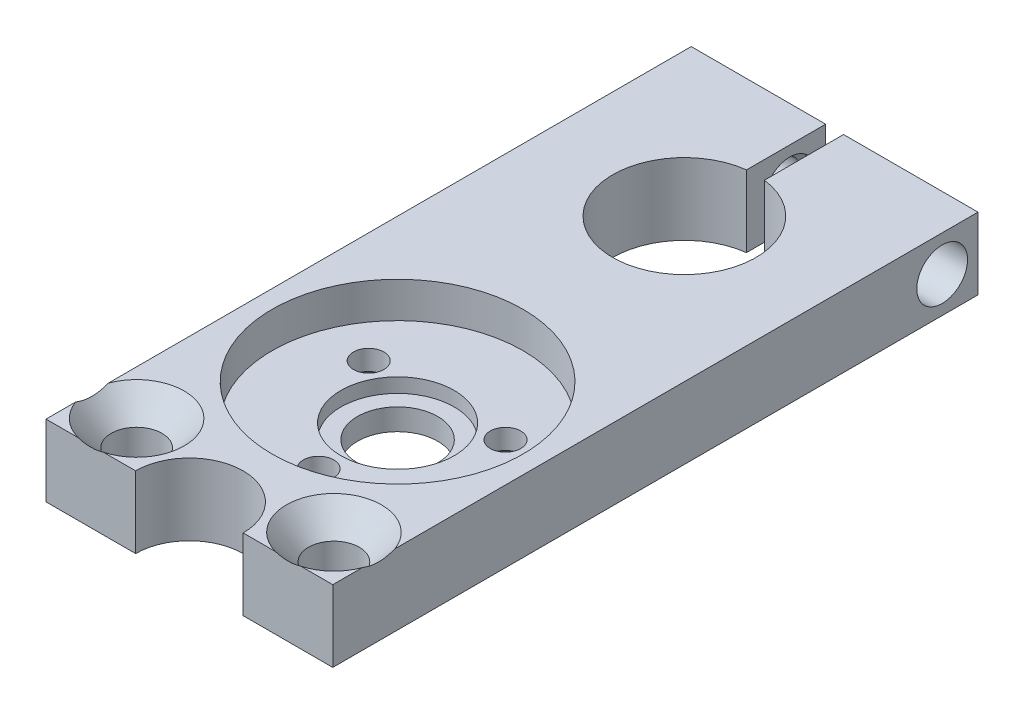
from build123d import *

# Parameters (mm, degrees)
SKETCH1_W                                         = 57.15
SKETCH1_H                                         = 6.35
EXTRUDE1_DEPTH                                    = 12.7
SKETCH2_R                                         = 11.1125
CUT_EXTRUDE1_DEPTH                                = 3.175
SKETCH3_R                                         = 5.0165
CUT_EXTRUDE2_DEPTH                                = 1.27
CUT_EXTRUDE3_REACH                                = 60.713
SKETCH4_R                                         = 3.556
CUT_EXTRUDE4_REACH                                = 60.887
SKETCH5_R                                         = 1.016
CSK_FOR_M2_5_FLAT_HEAD_MACHINE_SCREW1_D           = 2.7
CSK_FOR_M2_5_FLAT_HEAD_MACHINE_SCREW1_CSINK_D     = 5.5
CSK_FOR_M2_5_FLAT_HEAD_MACHINE_SCREW1_CSINK_ANGLE = 90
CUT_EXTRUDE5_REACH                                = 60.887
CUT_EXTRUDE6_REACH                                = 60.887
SKETCH12_R                                        = 4.7625
SKETCH15_W                                        = 1.7272
SKETCH15_H                                        = 11.90625
F_8_CLEARANCE_HOLE1_D                             = 4.4958
F_8_CLEARANCE_HOLE1_DEPTH                         = 13.97
F_8_CLEARANCE_HOLE1_TIP                           = 1.350674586
CSK_FOR_8_FLAT_HEAD_MACHINE_SCREW1_D              = 4.4958
CSK_FOR_8_FLAT_HEAD_MACHINE_SCREW1_CSINK_D        = 8.4328
CSK_FOR_8_FLAT_HEAD_MACHINE_SCREW1_CSINK_ANGLE    = 82


with BuildPart() as part:
    # Sketch1 → Extrude1 (new, symmetric)
    with BuildSketch(Plane(origin=(0, 0, 0), x_dir=(0, 0, -1), z_dir=(1, 0, 0))):
        with Locations((28.575, 0)):
            Rectangle(SKETCH1_W, SKETCH1_H)
    extrude(amount=EXTRUDE1_DEPTH, both=True)

    # Sketch2 → Cut-Extrude1 (cut)
    with BuildSketch(Plane(origin=(0, 3.175, 0), x_dir=(1, 0, 0), z_dir=(0, 1, 0))):
        with Locations(Location((0, 18.4404, 0), (0, 0, 270))):
            Circle(SKETCH2_R)
    extrude(amount=-CUT_EXTRUDE1_DEPTH, mode=Mode.SUBTRACT)

    # Sketch3 → Cut-Extrude2 (cut)
    with BuildSketch(Plane(origin=(0, 0, 0), x_dir=(1, 0, 0), z_dir=(0, 1, 0))):
        with Locations(Location((0, 18.4404, 0), (0, 0, 270))):
            Circle(SKETCH3_R)
    extrude(amount=-CUT_EXTRUDE2_DEPTH, mode=Mode.SUBTRACT)

    # Sketch4 → Cut-Extrude3 (cut, up to next)
    with BuildSketch(Plane(origin=(0, -1.27, 0), x_dir=(1, 0, 0), z_dir=(0, 1, 0)), mode=Mode.PRIVATE) as cut_extrude3_sk1:
        with Locations(Location((0, 18.4404, 0), (0, 0, 270))):
            Circle(SKETCH4_R)
    cut_extrude3_tool1 = extrude(cut_extrude3_sk1.sketch, amount=-CUT_EXTRUDE3_REACH, mode=Mode.PRIVATE) & part.part
    add(cut_extrude3_tool1.solids().sort_by_distance((0, -1.27, -18.4404))[0], mode=Mode.SUBTRACT)

    # Sketch5 → Cut-Extrude4 (cut, up to next)
    with BuildSketch(Plane.XZ.offset(3.175), mode=Mode.PRIVATE) as cut_extrude4_sk1:
        with Locations(Location((0, -11.4427, 0), (0, 0, 270))):
            Circle(SKETCH5_R)
    cut_extrude4_tool1 = extrude(cut_extrude4_sk1.sketch, amount=-CUT_EXTRUDE4_REACH, mode=Mode.PRIVATE) & part.part
    # Sketch5 → Cut-Extrude4 (cut, up to next)
    with BuildSketch(Plane.XZ.offset(3.175), mode=Mode.PRIVATE) as cut_extrude4_sk2:
        with Locations(Location((6.060185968, -21.93925, 0), (0, 0, 270))):
            Circle(SKETCH5_R)
    cut_extrude4_tool2 = extrude(cut_extrude4_sk2.sketch, amount=-CUT_EXTRUDE4_REACH, mode=Mode.PRIVATE) & part.part
    # Sketch5 → Cut-Extrude4 (cut, up to next)
    with BuildSketch(Plane.XZ.offset(3.175), mode=Mode.PRIVATE) as cut_extrude4_sk3:
        with Locations(Location((-6.060185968, -21.93925, 0), (0, 0, 270))):
            Circle(SKETCH5_R)
    cut_extrude4_tool3 = extrude(cut_extrude4_sk3.sketch, amount=-CUT_EXTRUDE4_REACH, mode=Mode.PRIVATE) & part.part
    add(cut_extrude4_tool1.solids().sort_by_distance((0, -3.175, -11.4427))[0], mode=Mode.SUBTRACT)
    add(cut_extrude4_tool2.solids().sort_by_distance((6.060186, -3.175, -21.93925))[0], mode=Mode.SUBTRACT)
    add(cut_extrude4_tool3.solids().sort_by_distance((-6.060186, -3.175, -21.93925))[0], mode=Mode.SUBTRACT)

    # CSK for M2.5 Flat Head Machine Screw1 (through all)
    with Locations(Plane(origin=(6.060185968, -3.175, -21.93925), x_dir=(0, 0, -1), z_dir=(0, -1, 0))):
        with Locations((0, 0), (0, -12.120371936), (-10.49655, -6.060185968)):
            CounterSinkHole(CSK_FOR_M2_5_FLAT_HEAD_MACHINE_SCREW1_D / 2, CSK_FOR_M2_5_FLAT_HEAD_MACHINE_SCREW1_CSINK_D / 2, counter_sink_angle=CSK_FOR_M2_5_FLAT_HEAD_MACHINE_SCREW1_CSINK_ANGLE)

    # Sketch7 → Cut-Extrude5 (cut, up to next)
    with BuildSketch(Plane(origin=(0, 3.175, 0), x_dir=(1, 0, 0), z_dir=(0, 1, 0)), mode=Mode.PRIVATE) as cut_extrude5_sk1:
        with BuildLine():
            Line((-0.79375, 57.15), (0.79375, 57.15))
            Line((0.79375, 57.15), (0.79375, 50.140595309))
            ThreePointArc((0.79375, 50.140595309), (0, 37.4904), (-0.79375, 50.140595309))
            Line((-0.79375, 50.140595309), (-0.79375, 57.15))
        make_face()
    cut_extrude5_tool1 = extrude(cut_extrude5_sk1.sketch, amount=-CUT_EXTRUDE5_REACH, mode=Mode.PRIVATE) & part.part
    add(cut_extrude5_tool1.solids().sort_by_distance((0, 3.175, -44.630009))[0], mode=Mode.SUBTRACT)

    # Sketch12 → Cut-Extrude6 (cut, up to next)
    with BuildSketch(Plane(origin=(0, 3.175, 0), x_dir=(1, 0, 0), z_dir=(0, 1, 0)), mode=Mode.PRIVATE) as cut_extrude6_sk1:
        Circle(SKETCH12_R)
    cut_extrude6_tool1 = extrude(cut_extrude6_sk1.sketch, amount=-CUT_EXTRUDE6_REACH, mode=Mode.PRIVATE) & part.part
    add(cut_extrude6_tool1.solids().sort_by_distance((0, 3.175, 0))[0], mode=Mode.SUBTRACT)

    # Sketch15 → 8-32 Tapped Hole3 (revolve, cut)
    with BuildSketch(Plane(origin=(-0.79375, 0, -53.975), x_dir=(0, 0, -1), z_dir=(0, 1, 0))):
        with Locations((0.8636, 5.953125)):
            Rectangle(SKETCH15_W, SKETCH15_H)
    revolve(axis=Axis((5.55625, 0, -53.975), (-1, 0, 0)), mode=Mode.SUBTRACT)

    # 8 Clearance Hole1
    with Locations(Plane(origin=(12.7, 0, -53.975), x_dir=(0, 0, 1), z_dir=(1, 0, 0))):
        with Locations((0, 0)):
            Hole(F_8_CLEARANCE_HOLE1_D / 2, depth=F_8_CLEARANCE_HOLE1_DEPTH)
            with Locations((0, 0, -(F_8_CLEARANCE_HOLE1_DEPTH + F_8_CLEARANCE_HOLE1_TIP / 2))):  # 118° drill point
                Cone(0, F_8_CLEARANCE_HOLE1_D / 2, F_8_CLEARANCE_HOLE1_TIP, mode=Mode.SUBTRACT)

    # CSK for _8 Flat Head Machine Screw1 (through all)
    with Locations(Plane(origin=(-8.7376, 3.175, -4.064), x_dir=(0, 0, 1), z_dir=(0, 1, 0))):
        with Locations((0, 0), (0, 17.4752)):
            CounterSinkHole(CSK_FOR_8_FLAT_HEAD_MACHINE_SCREW1_D / 2, CSK_FOR_8_FLAT_HEAD_MACHINE_SCREW1_CSINK_D / 2, counter_sink_angle=CSK_FOR_8_FLAT_HEAD_MACHINE_SCREW1_CSINK_ANGLE)


solid = part.part
